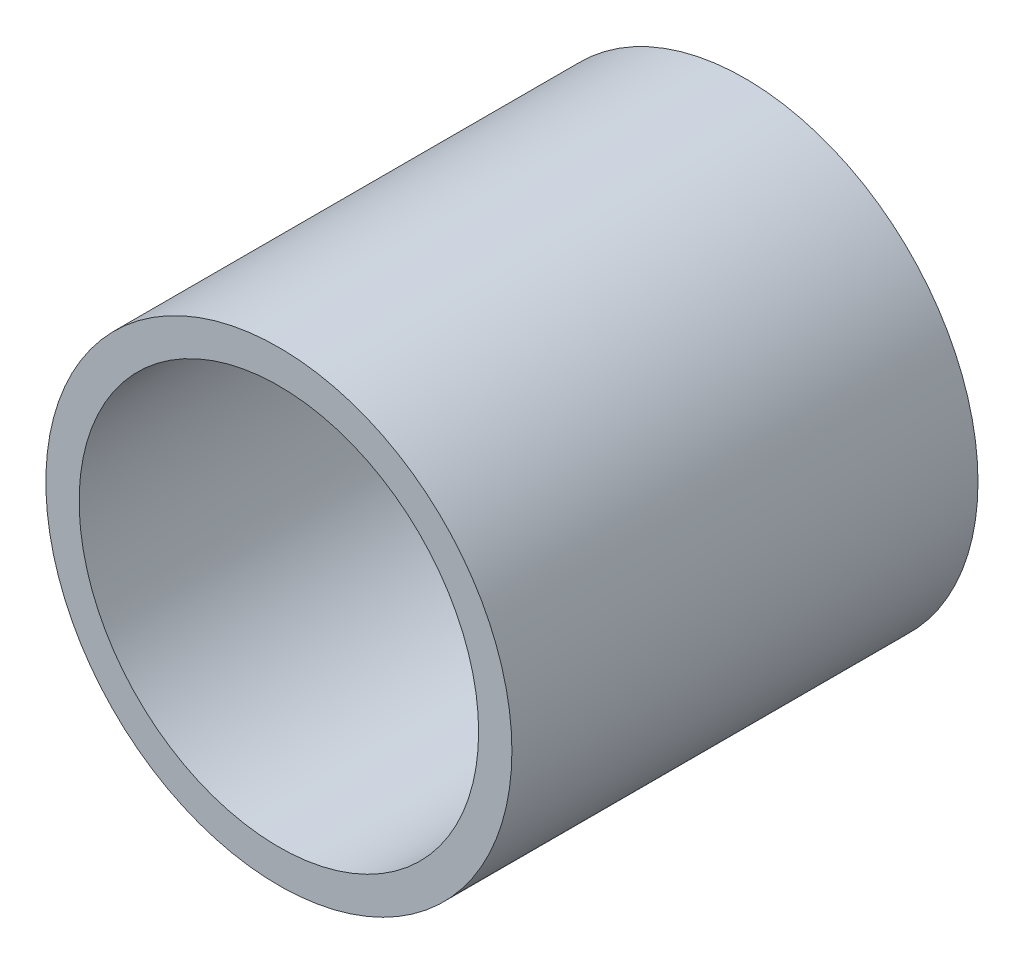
from build123d import *

# Parameters (mm, degrees)
ESQUISSE1_R        = 14
ESQUISSE1_R_2      = 12
BOSS_EXTRU_1_DEPTH = 28


with BuildPart() as part:
    # Esquisse1 → Boss.-Extru.1 (new body)
    with BuildSketch(Plane.XY):
        Circle(ESQUISSE1_R)
        Circle(ESQUISSE1_R_2, mode=Mode.SUBTRACT)
    extrude(amount=BOSS_EXTRU_1_DEPTH)


solid = part.part
